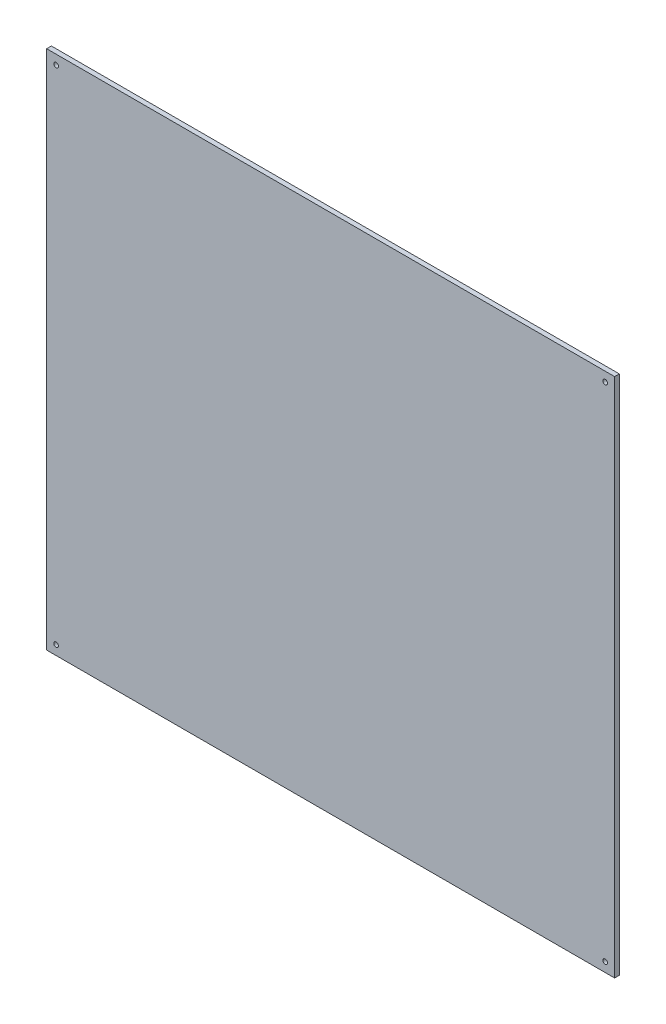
ISO-10303-21;
HEADER;
FILE_DESCRIPTION(('STEP AP214'),'2;1');
FILE_NAME('part.step','',(''),(''),'','','');
FILE_SCHEMA(('AUTOMOTIVE_DESIGN { 1 0 10303 214 1 1 1 1 }'));
ENDSEC;
DATA;
#1=APPLICATION_CONTEXT('core data for automotive mechanical design processes');
#2=APPLICATION_PROTOCOL_DEFINITION('international standard','automotive_design',2000,#1);
#3=PRODUCT_CONTEXT('',#1,'mechanical');
#4=PRODUCT('Part','Part','',(#3));
#5=PRODUCT_RELATED_PRODUCT_CATEGORY('part','',(#4));
#6=PRODUCT_DEFINITION_FORMATION('','',#4);
#7=PRODUCT_DEFINITION_CONTEXT('part definition',#1,'design');
#8=PRODUCT_DEFINITION('design','',#6,#7);
#9=PRODUCT_DEFINITION_SHAPE('','',#8);
#10=(LENGTH_UNIT() NAMED_UNIT(*) SI_UNIT(.MILLI.,.METRE.));
#11=(NAMED_UNIT(*) PLANE_ANGLE_UNIT() SI_UNIT($,.RADIAN.));
#12=(NAMED_UNIT(*) SI_UNIT($,.STERADIAN.) SOLID_ANGLE_UNIT());
#13=UNCERTAINTY_MEASURE_WITH_UNIT(LENGTH_MEASURE(1.E-05),#10,'distance_accuracy_value','');
#14=(GEOMETRIC_REPRESENTATION_CONTEXT(3) GLOBAL_UNCERTAINTY_ASSIGNED_CONTEXT((#13)) GLOBAL_UNIT_ASSIGNED_CONTEXT((#10,
#11,#12)) REPRESENTATION_CONTEXT('',''));
#15=CARTESIAN_POINT('',(0.,0.,0.));
#16=DIRECTION('',(0.,0.,1.));
#17=DIRECTION('',(1.,0.,0.));
#18=AXIS2_PLACEMENT_3D('',#15,#16,#17);
#19=CARTESIAN_POINT('',(0.,0.,3.));
#20=DIRECTION('',(0.,0.,1.));
#21=DIRECTION('',(1.,0.,0.));
#22=AXIS2_PLACEMENT_3D('',#19,#20,#21);
#23=PLANE('',#22);
#24=CARTESIAN_POINT('',(356.,326.,3.));
#25=DIRECTION('',(0.,0.,1.));
#26=DIRECTION('',(1.,0.,0.));
#27=AXIS2_PLACEMENT_3D('',#24,#25,#26);
#28=CIRCLE('',#27,1.50000000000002);
#29=CARTESIAN_POINT('',(357.5,326.,3.));
#30=VERTEX_POINT('',#29);
#31=EDGE_CURVE('E177',#30,#30,#28,.T.);
#32=ORIENTED_EDGE('',*,*,#31,.F.);
#33=EDGE_LOOP('',(#32));
#34=FACE_BOUND('',#33,.T.);
#35=CARTESIAN_POINT('',(6.00000000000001,326.,3.));
#36=DIRECTION('',(0.,0.,-1.));
#37=DIRECTION('',(-1.,0.,0.));
#38=AXIS2_PLACEMENT_3D('',#35,#36,#37);
#39=CIRCLE('',#38,1.50000000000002);
#40=CARTESIAN_POINT('',(4.49999999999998,326.,3.));
#41=VERTEX_POINT('',#40);
#42=EDGE_CURVE('E164',#41,#41,#39,.T.);
#43=ORIENTED_EDGE('',*,*,#42,.T.);
#44=EDGE_LOOP('',(#43));
#45=FACE_BOUND('',#44,.T.);
#46=DIRECTION('',(1.,0.,0.));
#47=VECTOR('',#46,1.);
#48=CARTESIAN_POINT('',(0.,0.,3.));
#49=LINE('',#48,#47);
#50=CARTESIAN_POINT('',(0.,0.,3.));
#51=VERTEX_POINT('',#50);
#52=CARTESIAN_POINT('',(362.,0.,3.));
#53=VERTEX_POINT('',#52);
#54=EDGE_CURVE('E148',#51,#53,#49,.T.);
#55=ORIENTED_EDGE('',*,*,#54,.T.);
#56=DIRECTION('',(0.,1.,0.));
#57=VECTOR('',#56,1.);
#58=CARTESIAN_POINT('',(362.,0.,3.));
#59=LINE('',#58,#57);
#60=CARTESIAN_POINT('',(362.,332.,3.));
#61=VERTEX_POINT('',#60);
#62=EDGE_CURVE('E140',#53,#61,#59,.T.);
#63=ORIENTED_EDGE('',*,*,#62,.T.);
#64=DIRECTION('',(1.,0.,0.));
#65=VECTOR('',#64,1.);
#66=CARTESIAN_POINT('',(0.,332.,3.));
#67=LINE('',#66,#65);
#68=CARTESIAN_POINT('',(0.,332.,3.));
#69=VERTEX_POINT('',#68);
#70=EDGE_CURVE('E147',#69,#61,#67,.T.);
#71=ORIENTED_EDGE('',*,*,#70,.F.);
#72=DIRECTION('',(0.,1.,0.));
#73=VECTOR('',#72,1.);
#74=CARTESIAN_POINT('',(0.,0.,3.));
#75=LINE('',#74,#73);
#76=EDGE_CURVE('E157',#51,#69,#75,.T.);
#77=ORIENTED_EDGE('',*,*,#76,.F.);
#78=EDGE_LOOP('',(#55,#63,#71,#77));
#79=FACE_BOUND('',#78,.T.);
#80=CARTESIAN_POINT('',(356.,6.00000000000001,3.));
#81=DIRECTION('',(0.,0.,-1.));
#82=DIRECTION('',(-1.,0.,0.));
#83=AXIS2_PLACEMENT_3D('',#80,#81,#82);
#84=CIRCLE('',#83,1.50000000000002);
#85=CARTESIAN_POINT('',(354.5,6.00000000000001,3.));
#86=VERTEX_POINT('',#85);
#87=EDGE_CURVE('E183',#86,#86,#84,.T.);
#88=ORIENTED_EDGE('',*,*,#87,.T.);
#89=EDGE_LOOP('',(#88));
#90=FACE_BOUND('',#89,.T.);
#91=CARTESIAN_POINT('',(6.00000000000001,6.00000000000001,3.));
#92=DIRECTION('',(0.,0.,1.));
#93=DIRECTION('',(1.,0.,0.));
#94=AXIS2_PLACEMENT_3D('',#91,#92,#93);
#95=CIRCLE('',#94,1.50000000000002);
#96=CARTESIAN_POINT('',(7.50000000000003,6.00000000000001,3.));
#97=VERTEX_POINT('',#96);
#98=EDGE_CURVE('E189',#97,#97,#95,.T.);
#99=ORIENTED_EDGE('',*,*,#98,.F.);
#100=EDGE_LOOP('',(#99));
#101=FACE_BOUND('',#100,.T.);
#102=ADVANCED_FACE('F98',(#34,#45,#79,#90,#101),#23,.T.);
#103=CARTESIAN_POINT('',(0.,0.,0.));
#104=DIRECTION('',(0.,0.,1.));
#105=DIRECTION('',(1.,0.,0.));
#106=AXIS2_PLACEMENT_3D('',#103,#104,#105);
#107=PLANE('',#106);
#108=CARTESIAN_POINT('',(356.,6.00000000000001,0.));
#109=DIRECTION('',(0.,0.,-1.));
#110=DIRECTION('',(-1.,0.,0.));
#111=AXIS2_PLACEMENT_3D('',#108,#109,#110);
#112=CIRCLE('',#111,1.50000000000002);
#113=CARTESIAN_POINT('',(354.5,6.00000000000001,0.));
#114=VERTEX_POINT('',#113);
#115=EDGE_CURVE('E186',#114,#114,#112,.T.);
#116=ORIENTED_EDGE('',*,*,#115,.F.);
#117=EDGE_LOOP('',(#116));
#118=FACE_BOUND('',#117,.T.);
#119=CARTESIAN_POINT('',(6.00000000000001,326.,0.));
#120=DIRECTION('',(0.,0.,-1.));
#121=DIRECTION('',(-1.,0.,0.));
#122=AXIS2_PLACEMENT_3D('',#119,#120,#121);
#123=CIRCLE('',#122,1.50000000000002);
#124=CARTESIAN_POINT('',(4.49999999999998,326.,0.));
#125=VERTEX_POINT('',#124);
#126=EDGE_CURVE('E174',#125,#125,#123,.T.);
#127=ORIENTED_EDGE('',*,*,#126,.F.);
#128=EDGE_LOOP('',(#127));
#129=FACE_BOUND('',#128,.T.);
#130=DIRECTION('',(1.,0.,0.));
#131=VECTOR('',#130,1.);
#132=CARTESIAN_POINT('',(0.,0.,0.));
#133=LINE('',#132,#131);
#134=CARTESIAN_POINT('',(0.,0.,0.));
#135=VERTEX_POINT('',#134);
#136=CARTESIAN_POINT('',(362.,0.,0.));
#137=VERTEX_POINT('',#136);
#138=EDGE_CURVE('E162',#135,#137,#133,.T.);
#139=ORIENTED_EDGE('',*,*,#138,.F.);
#140=DIRECTION('',(0.,1.,0.));
#141=VECTOR('',#140,1.);
#142=CARTESIAN_POINT('',(0.,0.,0.));
#143=LINE('',#142,#141);
#144=CARTESIAN_POINT('',(0.,332.,0.));
#145=VERTEX_POINT('',#144);
#146=EDGE_CURVE('E168',#135,#145,#143,.T.);
#147=ORIENTED_EDGE('',*,*,#146,.T.);
#148=DIRECTION('',(1.,0.,0.));
#149=VECTOR('',#148,1.);
#150=CARTESIAN_POINT('',(0.,332.,0.));
#151=LINE('',#150,#149);
#152=CARTESIAN_POINT('',(362.,332.,0.));
#153=VERTEX_POINT('',#152);
#154=EDGE_CURVE('E166',#145,#153,#151,.T.);
#155=ORIENTED_EDGE('',*,*,#154,.T.);
#156=DIRECTION('',(0.,1.,0.));
#157=VECTOR('',#156,1.);
#158=CARTESIAN_POINT('',(362.,0.,0.));
#159=LINE('',#158,#157);
#160=EDGE_CURVE('E153',#137,#153,#159,.T.);
#161=ORIENTED_EDGE('',*,*,#160,.F.);
#162=EDGE_LOOP('',(#139,#147,#155,#161));
#163=FACE_BOUND('',#162,.T.);
#164=CARTESIAN_POINT('',(356.,326.,0.));
#165=DIRECTION('',(0.,0.,1.));
#166=DIRECTION('',(1.,0.,0.));
#167=AXIS2_PLACEMENT_3D('',#164,#165,#166);
#168=CIRCLE('',#167,1.50000000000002);
#169=CARTESIAN_POINT('',(357.5,326.,0.));
#170=VERTEX_POINT('',#169);
#171=EDGE_CURVE('E180',#170,#170,#168,.T.);
#172=ORIENTED_EDGE('',*,*,#171,.T.);
#173=EDGE_LOOP('',(#172));
#174=FACE_BOUND('',#173,.T.);
#175=CARTESIAN_POINT('',(6.00000000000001,6.00000000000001,0.));
#176=DIRECTION('',(0.,0.,1.));
#177=DIRECTION('',(1.,0.,0.));
#178=AXIS2_PLACEMENT_3D('',#175,#176,#177);
#179=CIRCLE('',#178,1.50000000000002);
#180=CARTESIAN_POINT('',(7.50000000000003,6.00000000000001,0.));
#181=VERTEX_POINT('',#180);
#182=EDGE_CURVE('E192',#181,#181,#179,.T.);
#183=ORIENTED_EDGE('',*,*,#182,.T.);
#184=EDGE_LOOP('',(#183));
#185=FACE_BOUND('',#184,.T.);
#186=ADVANCED_FACE('F202',(#118,#129,#163,#174,#185),#107,.F.);
#187=CARTESIAN_POINT('',(0.,0.,3.));
#188=DIRECTION('',(0.,1.,0.));
#189=DIRECTION('',(0.,0.,1.));
#190=AXIS2_PLACEMENT_3D('',#187,#188,#189);
#191=PLANE('',#190);
#192=ORIENTED_EDGE('',*,*,#138,.T.);
#193=DIRECTION('',(0.,0.,-1.));
#194=VECTOR('',#193,1.);
#195=CARTESIAN_POINT('',(362.,0.,3.));
#196=LINE('',#195,#194);
#197=EDGE_CURVE('E12',#53,#137,#196,.T.);
#198=ORIENTED_EDGE('',*,*,#197,.F.);
#199=ORIENTED_EDGE('',*,*,#54,.F.);
#200=DIRECTION('',(0.,0.,-1.));
#201=VECTOR('',#200,1.);
#202=CARTESIAN_POINT('',(0.,0.,3.));
#203=LINE('',#202,#201);
#204=EDGE_CURVE('E115',#51,#135,#203,.T.);
#205=ORIENTED_EDGE('',*,*,#204,.T.);
#206=EDGE_LOOP('',(#192,#198,#199,#205));
#207=FACE_BOUND('',#206,.T.);
#208=ADVANCED_FACE('F100',(#207),#191,.F.);
#209=CARTESIAN_POINT('',(362.,0.,3.));
#210=DIRECTION('',(-1.,0.,0.));
#211=DIRECTION('',(0.,0.,1.));
#212=AXIS2_PLACEMENT_3D('',#209,#210,#211);
#213=PLANE('',#212);
#214=ORIENTED_EDGE('',*,*,#160,.T.);
#215=DIRECTION('',(0.,0.,-1.));
#216=VECTOR('',#215,1.);
#217=CARTESIAN_POINT('',(362.,332.,3.));
#218=LINE('',#217,#216);
#219=EDGE_CURVE('E107',#61,#153,#218,.T.);
#220=ORIENTED_EDGE('',*,*,#219,.F.);
#221=ORIENTED_EDGE('',*,*,#62,.F.);
#222=ORIENTED_EDGE('',*,*,#197,.T.);
#223=EDGE_LOOP('',(#214,#220,#221,#222));
#224=FACE_BOUND('',#223,.T.);
#225=ADVANCED_FACE('F152',(#224),#213,.F.);
#226=CARTESIAN_POINT('',(0.,332.,3.));
#227=DIRECTION('',(0.,1.,0.));
#228=DIRECTION('',(0.,0.,1.));
#229=AXIS2_PLACEMENT_3D('',#226,#227,#228);
#230=PLANE('',#229);
#231=ORIENTED_EDGE('',*,*,#154,.F.);
#232=DIRECTION('',(0.,0.,-1.));
#233=VECTOR('',#232,1.);
#234=CARTESIAN_POINT('',(0.,332.,3.));
#235=LINE('',#234,#233);
#236=EDGE_CURVE('E129',#69,#145,#235,.T.);
#237=ORIENTED_EDGE('',*,*,#236,.F.);
#238=ORIENTED_EDGE('',*,*,#70,.T.);
#239=ORIENTED_EDGE('',*,*,#219,.T.);
#240=EDGE_LOOP('',(#231,#237,#238,#239));
#241=FACE_BOUND('',#240,.T.);
#242=ADVANCED_FACE('F156',(#241),#230,.T.);
#243=CARTESIAN_POINT('',(0.,0.,3.));
#244=DIRECTION('',(-1.,0.,0.));
#245=DIRECTION('',(0.,0.,1.));
#246=AXIS2_PLACEMENT_3D('',#243,#244,#245);
#247=PLANE('',#246);
#248=ORIENTED_EDGE('',*,*,#146,.F.);
#249=ORIENTED_EDGE('',*,*,#204,.F.);
#250=ORIENTED_EDGE('',*,*,#76,.T.);
#251=ORIENTED_EDGE('',*,*,#236,.T.);
#252=EDGE_LOOP('',(#248,#249,#250,#251));
#253=FACE_BOUND('',#252,.T.);
#254=ADVANCED_FACE('F215',(#253),#247,.T.);
#255=CARTESIAN_POINT('',(6.00000000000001,326.,3.));
#256=DIRECTION('',(0.,0.,-1.));
#257=DIRECTION('',(-1.,0.,0.));
#258=AXIS2_PLACEMENT_3D('',#255,#256,#257);
#259=CYLINDRICAL_SURFACE('',#258,1.50000000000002);
#260=ORIENTED_EDGE('',*,*,#42,.F.);
#261=EDGE_LOOP('',(#260));
#262=FACE_BOUND('',#261,.T.);
#263=ORIENTED_EDGE('',*,*,#126,.T.);
#264=EDGE_LOOP('',(#263));
#265=FACE_BOUND('',#264,.T.);
#266=ADVANCED_FACE('F212',(#262,#265),#259,.F.);
#267=CARTESIAN_POINT('',(356.,326.,3.));
#268=DIRECTION('',(0.,0.,-1.));
#269=DIRECTION('',(-1.,0.,0.));
#270=AXIS2_PLACEMENT_3D('',#267,#268,#269);
#271=CYLINDRICAL_SURFACE('',#270,1.50000000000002);
#272=ORIENTED_EDGE('',*,*,#31,.T.);
#273=EDGE_LOOP('',(#272));
#274=FACE_BOUND('',#273,.T.);
#275=ORIENTED_EDGE('',*,*,#171,.F.);
#276=EDGE_LOOP('',(#275));
#277=FACE_BOUND('',#276,.T.);
#278=ADVANCED_FACE('F235',(#274,#277),#271,.F.);
#279=CARTESIAN_POINT('',(356.,6.00000000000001,3.));
#280=DIRECTION('',(0.,0.,-1.));
#281=DIRECTION('',(-1.,0.,0.));
#282=AXIS2_PLACEMENT_3D('',#279,#280,#281);
#283=CYLINDRICAL_SURFACE('',#282,1.50000000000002);
#284=ORIENTED_EDGE('',*,*,#87,.F.);
#285=EDGE_LOOP('',(#284));
#286=FACE_BOUND('',#285,.T.);
#287=ORIENTED_EDGE('',*,*,#115,.T.);
#288=EDGE_LOOP('',(#287));
#289=FACE_BOUND('',#288,.T.);
#290=ADVANCED_FACE('F230',(#286,#289),#283,.F.);
#291=CARTESIAN_POINT('',(6.00000000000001,6.00000000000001,3.));
#292=DIRECTION('',(0.,0.,-1.));
#293=DIRECTION('',(-1.,0.,0.));
#294=AXIS2_PLACEMENT_3D('',#291,#292,#293);
#295=CYLINDRICAL_SURFACE('',#294,1.50000000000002);
#296=ORIENTED_EDGE('',*,*,#98,.T.);
#297=EDGE_LOOP('',(#296));
#298=FACE_BOUND('',#297,.T.);
#299=ORIENTED_EDGE('',*,*,#182,.F.);
#300=EDGE_LOOP('',(#299));
#301=FACE_BOUND('',#300,.T.);
#302=ADVANCED_FACE('F198',(#298,#301),#295,.F.);
#303=CLOSED_SHELL('',(#102,#186,#208,#225,#242,#254,#266,#278,#290,#302));
#304=MANIFOLD_SOLID_BREP('B2',#303);
#305=ADVANCED_BREP_SHAPE_REPRESENTATION('',(#18,#304),#14);
#306=SHAPE_DEFINITION_REPRESENTATION(#9,#305);
ENDSEC;
END-ISO-10303-21;
